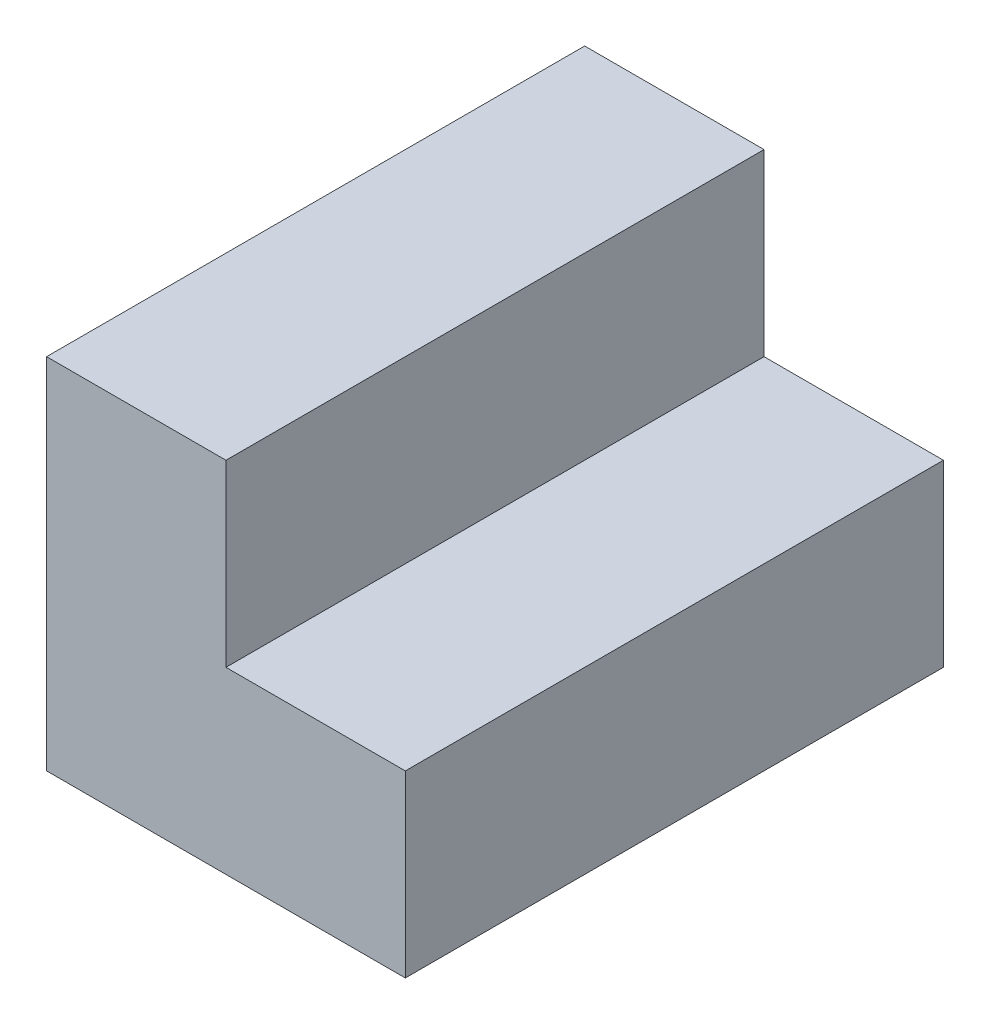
ISO-10303-21;
HEADER;
FILE_DESCRIPTION(('STEP AP214'),'2;1');
FILE_NAME('part.step','',(''),(''),'','','');
FILE_SCHEMA(('AUTOMOTIVE_DESIGN { 1 0 10303 214 1 1 1 1 }'));
ENDSEC;
DATA;
#1=APPLICATION_CONTEXT('core data for automotive mechanical design processes');
#2=APPLICATION_PROTOCOL_DEFINITION('international standard','automotive_design',2000,#1);
#3=PRODUCT_CONTEXT('',#1,'mechanical');
#4=PRODUCT('Part','Part','',(#3));
#5=PRODUCT_RELATED_PRODUCT_CATEGORY('part','',(#4));
#6=PRODUCT_DEFINITION_FORMATION('','',#4);
#7=PRODUCT_DEFINITION_CONTEXT('part definition',#1,'design');
#8=PRODUCT_DEFINITION('design','',#6,#7);
#9=PRODUCT_DEFINITION_SHAPE('','',#8);
#10=(LENGTH_UNIT() NAMED_UNIT(*) SI_UNIT(.MILLI.,.METRE.));
#11=(NAMED_UNIT(*) PLANE_ANGLE_UNIT() SI_UNIT($,.RADIAN.));
#12=(NAMED_UNIT(*) SI_UNIT($,.STERADIAN.) SOLID_ANGLE_UNIT());
#13=UNCERTAINTY_MEASURE_WITH_UNIT(LENGTH_MEASURE(1.E-05),#10,'distance_accuracy_value','');
#14=(GEOMETRIC_REPRESENTATION_CONTEXT(3) GLOBAL_UNCERTAINTY_ASSIGNED_CONTEXT((#13)) GLOBAL_UNIT_ASSIGNED_CONTEXT((#10,
#11,#12)) REPRESENTATION_CONTEXT('',''));
#15=CARTESIAN_POINT('',(0.,0.,0.));
#16=DIRECTION('',(0.,0.,1.));
#17=DIRECTION('',(1.,0.,0.));
#18=AXIS2_PLACEMENT_3D('',#15,#16,#17);
#19=CARTESIAN_POINT('',(-50.8,-61.1014213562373,152.4));
#20=DIRECTION('',(-1.,0.,0.));
#21=DIRECTION('',(0.,0.,1.));
#22=AXIS2_PLACEMENT_3D('',#19,#20,#21);
#23=PLANE('',#22);
#24=DIRECTION('',(0.,1.,0.));
#25=VECTOR('',#24,1.);
#26=CARTESIAN_POINT('',(-50.8,-61.1014213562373,0.));
#27=LINE('',#26,#25);
#28=CARTESIAN_POINT('',(-50.8,0.,0.));
#29=VERTEX_POINT('',#28);
#30=CARTESIAN_POINT('',(-50.8,101.6,0.));
#31=VERTEX_POINT('',#30);
#32=EDGE_CURVE('E85',#29,#31,#27,.T.);
#33=ORIENTED_EDGE('',*,*,#32,.F.);
#34=DIRECTION('',(0.,0.,-1.));
#35=VECTOR('',#34,1.);
#36=CARTESIAN_POINT('',(-50.8,0.,152.4));
#37=LINE('',#36,#35);
#38=CARTESIAN_POINT('',(-50.8,0.,152.4));
#39=VERTEX_POINT('',#38);
#40=EDGE_CURVE('E11',#39,#29,#37,.T.);
#41=ORIENTED_EDGE('',*,*,#40,.F.);
#42=DIRECTION('',(0.,1.,0.));
#43=VECTOR('',#42,1.);
#44=CARTESIAN_POINT('',(-50.8,-61.1014213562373,152.4));
#45=LINE('',#44,#43);
#46=CARTESIAN_POINT('',(-50.8,101.6,152.4));
#47=VERTEX_POINT('',#46);
#48=EDGE_CURVE('E105',#39,#47,#45,.T.);
#49=ORIENTED_EDGE('',*,*,#48,.T.);
#50=DIRECTION('',(0.,0.,-1.));
#51=VECTOR('',#50,1.);
#52=CARTESIAN_POINT('',(-50.8,101.6,152.4));
#53=LINE('',#52,#51);
#54=EDGE_CURVE('E86',#47,#31,#53,.T.);
#55=ORIENTED_EDGE('',*,*,#54,.T.);
#56=EDGE_LOOP('',(#33,#41,#49,#55));
#57=FACE_BOUND('',#56,.T.);
#58=ADVANCED_FACE('F24',(#57),#23,.T.);
#59=CARTESIAN_POINT('',(0.,0.,152.4));
#60=DIRECTION('',(0.,-1.,0.));
#61=DIRECTION('',(1.,0.,0.));
#62=AXIS2_PLACEMENT_3D('',#59,#60,#61);
#63=PLANE('',#62);
#64=DIRECTION('',(-1.,0.,0.));
#65=VECTOR('',#64,1.);
#66=CARTESIAN_POINT('',(0.,0.,0.));
#67=LINE('',#66,#65);
#68=CARTESIAN_POINT('',(50.8,0.,0.));
#69=VERTEX_POINT('',#68);
#70=EDGE_CURVE('E79',#69,#29,#67,.T.);
#71=ORIENTED_EDGE('',*,*,#70,.F.);
#72=DIRECTION('',(0.,0.,-1.));
#73=VECTOR('',#72,1.);
#74=CARTESIAN_POINT('',(50.8,0.,152.4));
#75=LINE('',#74,#73);
#76=CARTESIAN_POINT('',(50.8,0.,152.4));
#77=VERTEX_POINT('',#76);
#78=EDGE_CURVE('E31',#77,#69,#75,.T.);
#79=ORIENTED_EDGE('',*,*,#78,.F.);
#80=DIRECTION('',(-1.,0.,0.));
#81=VECTOR('',#80,1.);
#82=CARTESIAN_POINT('',(0.,0.,152.4));
#83=LINE('',#82,#81);
#84=EDGE_CURVE('E81',#77,#39,#83,.T.);
#85=ORIENTED_EDGE('',*,*,#84,.T.);
#86=ORIENTED_EDGE('',*,*,#40,.T.);
#87=EDGE_LOOP('',(#71,#79,#85,#86));
#88=FACE_BOUND('',#87,.T.);
#89=ADVANCED_FACE('F77',(#88),#63,.T.);
#90=CARTESIAN_POINT('',(50.8,-61.1014213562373,152.4));
#91=DIRECTION('',(-1.,0.,0.));
#92=DIRECTION('',(0.,-1.,0.));
#93=AXIS2_PLACEMENT_3D('',#90,#91,#92);
#94=PLANE('',#93);
#95=DIRECTION('',(0.,1.,0.));
#96=VECTOR('',#95,1.);
#97=CARTESIAN_POINT('',(50.8,-61.1014213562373,0.));
#98=LINE('',#97,#96);
#99=CARTESIAN_POINT('',(50.8,50.8,0.));
#100=VERTEX_POINT('',#99);
#101=EDGE_CURVE('E95',#69,#100,#98,.T.);
#102=ORIENTED_EDGE('',*,*,#101,.T.);
#103=DIRECTION('',(0.,0.,-1.));
#104=VECTOR('',#103,1.);
#105=CARTESIAN_POINT('',(50.8,50.8,152.4));
#106=LINE('',#105,#104);
#107=CARTESIAN_POINT('',(50.8,50.8,152.4));
#108=VERTEX_POINT('',#107);
#109=EDGE_CURVE('E121',#108,#100,#106,.T.);
#110=ORIENTED_EDGE('',*,*,#109,.F.);
#111=DIRECTION('',(0.,1.,0.));
#112=VECTOR('',#111,1.);
#113=CARTESIAN_POINT('',(50.8,-61.1014213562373,152.4));
#114=LINE('',#113,#112);
#115=EDGE_CURVE('E108',#77,#108,#114,.T.);
#116=ORIENTED_EDGE('',*,*,#115,.F.);
#117=ORIENTED_EDGE('',*,*,#78,.T.);
#118=EDGE_LOOP('',(#102,#110,#116,#117));
#119=FACE_BOUND('',#118,.T.);
#120=ADVANCED_FACE('F124',(#119),#94,.F.);
#121=CARTESIAN_POINT('',(0.,50.8,152.4));
#122=DIRECTION('',(0.,1.,0.));
#123=DIRECTION('',(0.,0.,1.));
#124=AXIS2_PLACEMENT_3D('',#121,#122,#123);
#125=PLANE('',#124);
#126=DIRECTION('',(1.,0.,0.));
#127=VECTOR('',#126,1.);
#128=CARTESIAN_POINT('',(0.,50.8,0.));
#129=LINE('',#128,#127);
#130=CARTESIAN_POINT('',(0.,50.8,0.));
#131=VERTEX_POINT('',#130);
#132=EDGE_CURVE('E97',#131,#100,#129,.T.);
#133=ORIENTED_EDGE('',*,*,#132,.F.);
#134=DIRECTION('',(0.,0.,-1.));
#135=VECTOR('',#134,1.);
#136=CARTESIAN_POINT('',(0.,50.8,152.4));
#137=LINE('',#136,#135);
#138=CARTESIAN_POINT('',(0.,50.8,152.4));
#139=VERTEX_POINT('',#138);
#140=EDGE_CURVE('E119',#139,#131,#137,.T.);
#141=ORIENTED_EDGE('',*,*,#140,.F.);
#142=DIRECTION('',(1.,0.,0.));
#143=VECTOR('',#142,1.);
#144=CARTESIAN_POINT('',(0.,50.8,152.4));
#145=LINE('',#144,#143);
#146=EDGE_CURVE('E110',#139,#108,#145,.T.);
#147=ORIENTED_EDGE('',*,*,#146,.T.);
#148=ORIENTED_EDGE('',*,*,#109,.T.);
#149=EDGE_LOOP('',(#133,#141,#147,#148));
#150=FACE_BOUND('',#149,.T.);
#151=ADVANCED_FACE('F145',(#150),#125,.T.);
#152=CARTESIAN_POINT('',(0.,-61.1014213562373,152.4));
#153=DIRECTION('',(-1.,0.,0.));
#154=DIRECTION('',(0.,0.,1.));
#155=AXIS2_PLACEMENT_3D('',#152,#153,#154);
#156=PLANE('',#155);
#157=DIRECTION('',(0.,1.,0.));
#158=VECTOR('',#157,1.);
#159=CARTESIAN_POINT('',(0.,-61.1014213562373,0.));
#160=LINE('',#159,#158);
#161=CARTESIAN_POINT('',(0.,101.6,0.));
#162=VERTEX_POINT('',#161);
#163=EDGE_CURVE('E101',#131,#162,#160,.T.);
#164=ORIENTED_EDGE('',*,*,#163,.T.);
#165=DIRECTION('',(0.,0.,-1.));
#166=VECTOR('',#165,1.);
#167=CARTESIAN_POINT('',(0.,101.6,152.4));
#168=LINE('',#167,#166);
#169=CARTESIAN_POINT('',(0.,101.6,152.4));
#170=VERTEX_POINT('',#169);
#171=EDGE_CURVE('E116',#170,#162,#168,.T.);
#172=ORIENTED_EDGE('',*,*,#171,.F.);
#173=DIRECTION('',(0.,1.,0.));
#174=VECTOR('',#173,1.);
#175=CARTESIAN_POINT('',(0.,-61.1014213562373,152.4));
#176=LINE('',#175,#174);
#177=EDGE_CURVE('E43',#139,#170,#176,.T.);
#178=ORIENTED_EDGE('',*,*,#177,.F.);
#179=ORIENTED_EDGE('',*,*,#140,.T.);
#180=EDGE_LOOP('',(#164,#172,#178,#179));
#181=FACE_BOUND('',#180,.T.);
#182=ADVANCED_FACE('F135',(#181),#156,.F.);
#183=CARTESIAN_POINT('',(0.,101.6,152.4));
#184=DIRECTION('',(0.,-1.,0.));
#185=DIRECTION('',(1.,0.,0.));
#186=AXIS2_PLACEMENT_3D('',#183,#184,#185);
#187=PLANE('',#186);
#188=DIRECTION('',(-1.,0.,0.));
#189=VECTOR('',#188,1.);
#190=CARTESIAN_POINT('',(0.,101.6,0.));
#191=LINE('',#190,#189);
#192=EDGE_CURVE('E103',#162,#31,#191,.T.);
#193=ORIENTED_EDGE('',*,*,#192,.T.);
#194=ORIENTED_EDGE('',*,*,#54,.F.);
#195=DIRECTION('',(-1.,0.,0.));
#196=VECTOR('',#195,1.);
#197=CARTESIAN_POINT('',(0.,101.6,152.4));
#198=LINE('',#197,#196);
#199=EDGE_CURVE('E38',#170,#47,#198,.T.);
#200=ORIENTED_EDGE('',*,*,#199,.F.);
#201=ORIENTED_EDGE('',*,*,#171,.T.);
#202=EDGE_LOOP('',(#193,#194,#200,#201));
#203=FACE_BOUND('',#202,.T.);
#204=ADVANCED_FACE('F128',(#203),#187,.F.);
#205=CARTESIAN_POINT('',(0.,-61.1014213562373,152.4));
#206=DIRECTION('',(0.,0.,1.));
#207=DIRECTION('',(1.,0.,0.));
#208=AXIS2_PLACEMENT_3D('',#205,#206,#207);
#209=PLANE('',#208);
#210=ORIENTED_EDGE('',*,*,#48,.F.);
#211=ORIENTED_EDGE('',*,*,#84,.F.);
#212=ORIENTED_EDGE('',*,*,#115,.T.);
#213=ORIENTED_EDGE('',*,*,#146,.F.);
#214=ORIENTED_EDGE('',*,*,#177,.T.);
#215=ORIENTED_EDGE('',*,*,#199,.T.);
#216=EDGE_LOOP('',(#210,#211,#212,#213,#214,#215));
#217=FACE_BOUND('',#216,.T.);
#218=ADVANCED_FACE('F126',(#217),#209,.T.);
#219=CARTESIAN_POINT('',(0.,-61.1014213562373,0.));
#220=DIRECTION('',(0.,0.,1.));
#221=DIRECTION('',(1.,0.,0.));
#222=AXIS2_PLACEMENT_3D('',#219,#220,#221);
#223=PLANE('',#222);
#224=ORIENTED_EDGE('',*,*,#32,.T.);
#225=ORIENTED_EDGE('',*,*,#192,.F.);
#226=ORIENTED_EDGE('',*,*,#163,.F.);
#227=ORIENTED_EDGE('',*,*,#132,.T.);
#228=ORIENTED_EDGE('',*,*,#101,.F.);
#229=ORIENTED_EDGE('',*,*,#70,.T.);
#230=EDGE_LOOP('',(#224,#225,#226,#227,#228,#229));
#231=FACE_BOUND('',#230,.T.);
#232=ADVANCED_FACE('F92',(#231),#223,.F.);
#233=CLOSED_SHELL('',(#58,#89,#120,#151,#182,#204,#218,#232));
#234=MANIFOLD_SOLID_BREP('B2',#233);
#235=ADVANCED_BREP_SHAPE_REPRESENTATION('',(#18,#234),#14);
#236=SHAPE_DEFINITION_REPRESENTATION(#9,#235);
ENDSEC;
END-ISO-10303-21;
